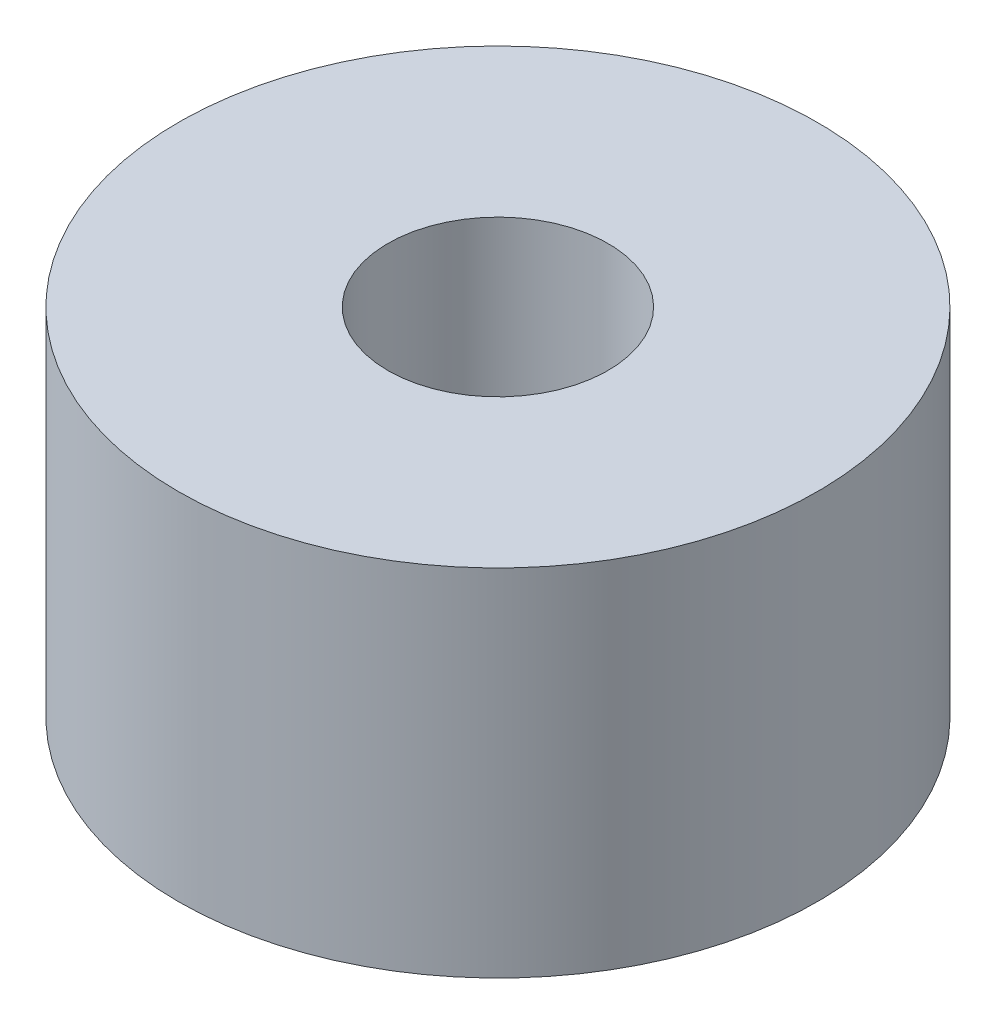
ISO-10303-21;
HEADER;
FILE_DESCRIPTION(('STEP AP214'),'2;1');
FILE_NAME('part.step','',(''),(''),'','','');
FILE_SCHEMA(('AUTOMOTIVE_DESIGN { 1 0 10303 214 1 1 1 1 }'));
ENDSEC;
DATA;
#1=APPLICATION_CONTEXT('core data for automotive mechanical design processes');
#2=APPLICATION_PROTOCOL_DEFINITION('international standard','automotive_design',2000,#1);
#3=PRODUCT_CONTEXT('',#1,'mechanical');
#4=PRODUCT('Part','Part','',(#3));
#5=PRODUCT_RELATED_PRODUCT_CATEGORY('part','',(#4));
#6=PRODUCT_DEFINITION_FORMATION('','',#4);
#7=PRODUCT_DEFINITION_CONTEXT('part definition',#1,'design');
#8=PRODUCT_DEFINITION('design','',#6,#7);
#9=PRODUCT_DEFINITION_SHAPE('','',#8);
#10=(LENGTH_UNIT() NAMED_UNIT(*) SI_UNIT(.MILLI.,.METRE.));
#11=(NAMED_UNIT(*) PLANE_ANGLE_UNIT() SI_UNIT($,.RADIAN.));
#12=(NAMED_UNIT(*) SI_UNIT($,.STERADIAN.) SOLID_ANGLE_UNIT());
#13=UNCERTAINTY_MEASURE_WITH_UNIT(LENGTH_MEASURE(1.E-05),#10,'distance_accuracy_value','');
#14=(GEOMETRIC_REPRESENTATION_CONTEXT(3) GLOBAL_UNCERTAINTY_ASSIGNED_CONTEXT((#13)) GLOBAL_UNIT_ASSIGNED_CONTEXT((#10,
#11,#12)) REPRESENTATION_CONTEXT('',''));
#15=CARTESIAN_POINT('',(0.,0.,0.));
#16=DIRECTION('',(0.,0.,1.));
#17=DIRECTION('',(1.,0.,0.));
#18=AXIS2_PLACEMENT_3D('',#15,#16,#17);
#19=CARTESIAN_POINT('',(0.,5.,0.));
#20=DIRECTION('',(0.,1.,0.));
#21=DIRECTION('',(0.,0.,1.));
#22=AXIS2_PLACEMENT_3D('',#19,#20,#21);
#23=PLANE('',#22);
#24=CARTESIAN_POINT('',(0.,5.,0.));
#25=DIRECTION('',(0.,1.,0.));
#26=DIRECTION('',(0.,0.,1.));
#27=AXIS2_PLACEMENT_3D('',#24,#25,#26);
#28=CIRCLE('',#27,4.5);
#29=CARTESIAN_POINT('',(0.,5.,4.5));
#30=VERTEX_POINT('',#29);
#31=EDGE_CURVE('E10',#30,#30,#28,.T.);
#32=ORIENTED_EDGE('',*,*,#31,.T.);
#33=EDGE_LOOP('',(#32));
#34=FACE_BOUND('',#33,.T.);
#35=CARTESIAN_POINT('',(0.,5.,0.));
#36=DIRECTION('',(0.,1.,0.));
#37=DIRECTION('',(0.,0.,1.));
#38=AXIS2_PLACEMENT_3D('',#35,#36,#37);
#39=CIRCLE('',#38,1.55);
#40=CARTESIAN_POINT('',(0.,5.,1.55));
#41=VERTEX_POINT('',#40);
#42=EDGE_CURVE('E42',#41,#41,#39,.T.);
#43=ORIENTED_EDGE('',*,*,#42,.F.);
#44=EDGE_LOOP('',(#43));
#45=FACE_BOUND('',#44,.T.);
#46=ADVANCED_FACE('F31',(#34,#45),#23,.T.);
#47=CARTESIAN_POINT('',(0.,0.,0.));
#48=DIRECTION('',(0.,1.,0.));
#49=DIRECTION('',(0.,0.,1.));
#50=AXIS2_PLACEMENT_3D('',#47,#48,#49);
#51=PLANE('',#50);
#52=CARTESIAN_POINT('',(0.,0.,0.));
#53=DIRECTION('',(0.,1.,0.));
#54=DIRECTION('',(0.,0.,1.));
#55=AXIS2_PLACEMENT_3D('',#52,#53,#54);
#56=CIRCLE('',#55,4.5);
#57=CARTESIAN_POINT('',(0.,0.,4.5));
#58=VERTEX_POINT('',#57);
#59=EDGE_CURVE('E35',#58,#58,#56,.T.);
#60=ORIENTED_EDGE('',*,*,#59,.F.);
#61=EDGE_LOOP('',(#60));
#62=FACE_BOUND('',#61,.T.);
#63=CARTESIAN_POINT('',(0.,0.,0.));
#64=DIRECTION('',(0.,1.,0.));
#65=DIRECTION('',(0.,0.,1.));
#66=AXIS2_PLACEMENT_3D('',#63,#64,#65);
#67=CIRCLE('',#66,1.55);
#68=CARTESIAN_POINT('',(0.,0.,1.55));
#69=VERTEX_POINT('',#68);
#70=EDGE_CURVE('E44',#69,#69,#67,.T.);
#71=ORIENTED_EDGE('',*,*,#70,.T.);
#72=EDGE_LOOP('',(#71));
#73=FACE_BOUND('',#72,.T.);
#74=ADVANCED_FACE('F54',(#62,#73),#51,.F.);
#75=CARTESIAN_POINT('',(0.,5.,0.));
#76=DIRECTION('',(0.,-1.,0.));
#77=DIRECTION('',(0.,0.,-1.));
#78=AXIS2_PLACEMENT_3D('',#75,#76,#77);
#79=CYLINDRICAL_SURFACE('',#78,4.5);
#80=ORIENTED_EDGE('',*,*,#31,.F.);
#81=EDGE_LOOP('',(#80));
#82=FACE_BOUND('',#81,.T.);
#83=ORIENTED_EDGE('',*,*,#59,.T.);
#84=EDGE_LOOP('',(#83));
#85=FACE_BOUND('',#84,.T.);
#86=ADVANCED_FACE('F33',(#82,#85),#79,.T.);
#87=CARTESIAN_POINT('',(0.,5.,0.));
#88=DIRECTION('',(0.,-1.,0.));
#89=DIRECTION('',(0.,0.,-1.));
#90=AXIS2_PLACEMENT_3D('',#87,#88,#89);
#91=CYLINDRICAL_SURFACE('',#90,1.55);
#92=ORIENTED_EDGE('',*,*,#42,.T.);
#93=EDGE_LOOP('',(#92));
#94=FACE_BOUND('',#93,.T.);
#95=ORIENTED_EDGE('',*,*,#70,.F.);
#96=EDGE_LOOP('',(#95));
#97=FACE_BOUND('',#96,.T.);
#98=ADVANCED_FACE('F50',(#94,#97),#91,.F.);
#99=CLOSED_SHELL('',(#46,#74,#86,#98));
#100=MANIFOLD_SOLID_BREP('B2',#99);
#101=ADVANCED_BREP_SHAPE_REPRESENTATION('',(#18,#100),#14);
#102=SHAPE_DEFINITION_REPRESENTATION(#9,#101);
ENDSEC;
END-ISO-10303-21;
